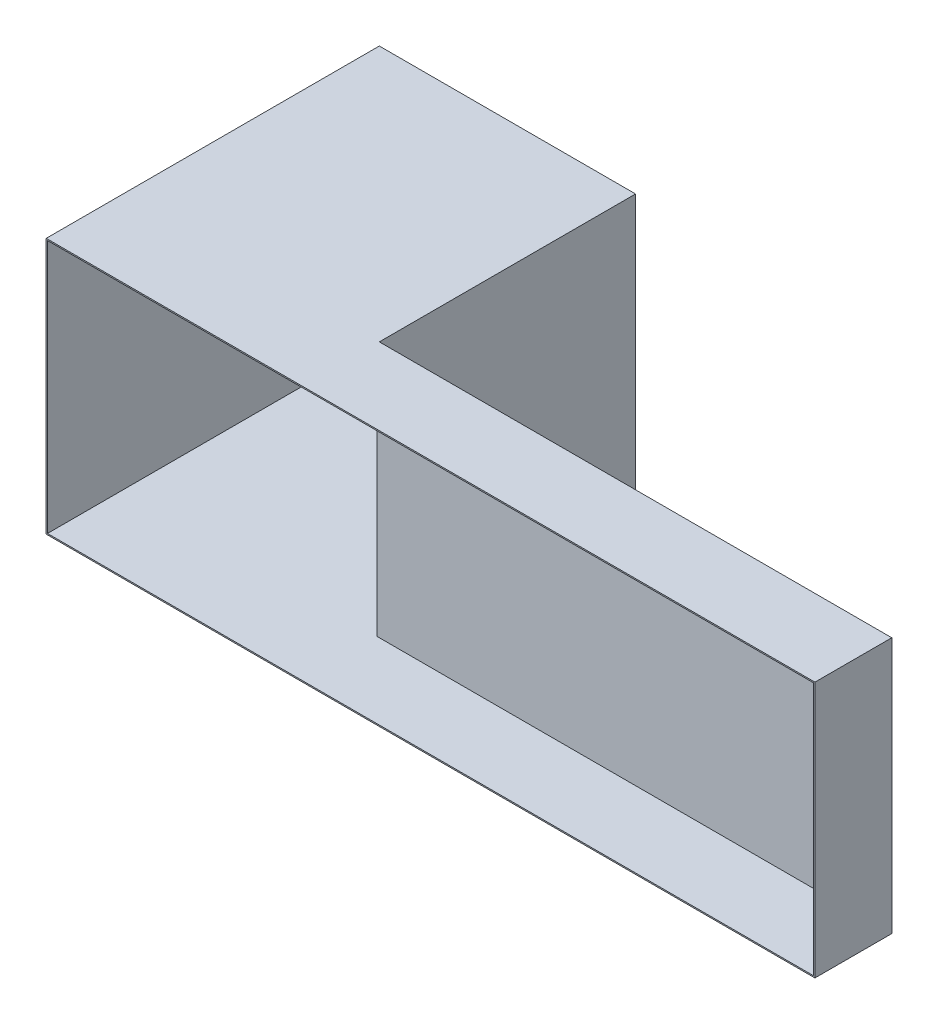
ISO-10303-21;
HEADER;
FILE_DESCRIPTION(('STEP AP214'),'2;1');
FILE_NAME('part.step','',(''),(''),'','','');
FILE_SCHEMA(('AUTOMOTIVE_DESIGN { 1 0 10303 214 1 1 1 1 }'));
ENDSEC;
DATA;
#1=APPLICATION_CONTEXT('core data for automotive mechanical design processes');
#2=APPLICATION_PROTOCOL_DEFINITION('international standard','automotive_design',2000,#1);
#3=PRODUCT_CONTEXT('',#1,'mechanical');
#4=PRODUCT('Part','Part','',(#3));
#5=PRODUCT_RELATED_PRODUCT_CATEGORY('part','',(#4));
#6=PRODUCT_DEFINITION_FORMATION('','',#4);
#7=PRODUCT_DEFINITION_CONTEXT('part definition',#1,'design');
#8=PRODUCT_DEFINITION('design','',#6,#7);
#9=PRODUCT_DEFINITION_SHAPE('','',#8);
#10=(LENGTH_UNIT() NAMED_UNIT(*) SI_UNIT(.MILLI.,.METRE.));
#11=(NAMED_UNIT(*) PLANE_ANGLE_UNIT() SI_UNIT($,.RADIAN.));
#12=(NAMED_UNIT(*) SI_UNIT($,.STERADIAN.) SOLID_ANGLE_UNIT());
#13=UNCERTAINTY_MEASURE_WITH_UNIT(LENGTH_MEASURE(1.E-05),#10,'distance_accuracy_value','');
#14=(GEOMETRIC_REPRESENTATION_CONTEXT(3) GLOBAL_UNCERTAINTY_ASSIGNED_CONTEXT((#13)) GLOBAL_UNIT_ASSIGNED_CONTEXT((#10,
#11,#12)) REPRESENTATION_CONTEXT('',''));
#15=CARTESIAN_POINT('',(0.,0.,0.));
#16=DIRECTION('',(0.,0.,1.));
#17=DIRECTION('',(1.,0.,0.));
#18=AXIS2_PLACEMENT_3D('',#15,#16,#17);
#19=CARTESIAN_POINT('',(0.,250.,150.));
#20=DIRECTION('',(0.,0.,-1.));
#21=DIRECTION('',(-1.,0.,0.));
#22=AXIS2_PLACEMENT_3D('',#19,#20,#21);
#23=PLANE('',#22);
#24=DIRECTION('',(0.,-1.,0.));
#25=VECTOR('',#24,1.);
#26=CARTESIAN_POINT('',(0.,-250.,150.));
#27=LINE('',#26,#25);
#28=CARTESIAN_POINT('',(0.,250.,150.));
#29=VERTEX_POINT('',#28);
#30=CARTESIAN_POINT('',(0.,-250.,150.));
#31=VERTEX_POINT('',#30);
#32=EDGE_CURVE('E191',#29,#31,#27,.T.);
#33=ORIENTED_EDGE('',*,*,#32,.T.);
#34=DIRECTION('',(1.,0.,0.));
#35=VECTOR('',#34,1.);
#36=CARTESIAN_POINT('',(0.,-250.,150.));
#37=LINE('',#36,#35);
#38=CARTESIAN_POINT('',(1500.,-250.,150.));
#39=VERTEX_POINT('',#38);
#40=EDGE_CURVE('E237',#31,#39,#37,.T.);
#41=ORIENTED_EDGE('',*,*,#40,.T.);
#42=DIRECTION('',(0.,1.,0.));
#43=VECTOR('',#42,1.);
#44=CARTESIAN_POINT('',(1500.,-250.,150.));
#45=LINE('',#44,#43);
#46=CARTESIAN_POINT('',(1500.,250.,150.));
#47=VERTEX_POINT('',#46);
#48=EDGE_CURVE('E234',#39,#47,#45,.T.);
#49=ORIENTED_EDGE('',*,*,#48,.T.);
#50=DIRECTION('',(-1.,0.,0.));
#51=VECTOR('',#50,1.);
#52=CARTESIAN_POINT('',(0.,250.,150.));
#53=LINE('',#52,#51);
#54=EDGE_CURVE('E228',#47,#29,#53,.T.);
#55=ORIENTED_EDGE('',*,*,#54,.T.);
#56=EDGE_LOOP('',(#33,#41,#49,#55));
#57=FACE_BOUND('',#56,.T.);
#58=DIRECTION('',(0.,-1.,0.));
#59=VECTOR('',#58,1.);
#60=CARTESIAN_POINT('',(2.5,250.,150.));
#61=LINE('',#60,#59);
#62=CARTESIAN_POINT('',(2.5,247.5,150.));
#63=VERTEX_POINT('',#62);
#64=CARTESIAN_POINT('',(2.5,-247.5,150.));
#65=VERTEX_POINT('',#64);
#66=EDGE_CURVE('E169',#63,#65,#61,.T.);
#67=ORIENTED_EDGE('',*,*,#66,.F.);
#68=DIRECTION('',(-1.,0.,0.));
#69=VECTOR('',#68,1.);
#70=CARTESIAN_POINT('',(0.,247.5,150.));
#71=LINE('',#70,#69);
#72=CARTESIAN_POINT('',(1497.5,247.5,150.));
#73=VERTEX_POINT('',#72);
#74=EDGE_CURVE('E129',#73,#63,#71,.T.);
#75=ORIENTED_EDGE('',*,*,#74,.F.);
#76=DIRECTION('',(0.,1.,0.));
#77=VECTOR('',#76,1.);
#78=CARTESIAN_POINT('',(1497.5,250.,150.));
#79=LINE('',#78,#77);
#80=CARTESIAN_POINT('',(1497.5,-247.5,150.));
#81=VERTEX_POINT('',#80);
#82=EDGE_CURVE('E175',#81,#73,#79,.T.);
#83=ORIENTED_EDGE('',*,*,#82,.F.);
#84=DIRECTION('',(1.,0.,0.));
#85=VECTOR('',#84,1.);
#86=CARTESIAN_POINT('',(0.,-247.5,150.));
#87=LINE('',#86,#85);
#88=EDGE_CURVE('E173',#65,#81,#87,.T.);
#89=ORIENTED_EDGE('',*,*,#88,.F.);
#90=EDGE_LOOP('',(#67,#75,#83,#89));
#91=FACE_BOUND('',#90,.T.);
#92=ADVANCED_FACE('F32',(#57,#91),#23,.F.);
#93=CARTESIAN_POINT('',(0.,-250.,150.));
#94=DIRECTION('',(1.,0.,0.));
#95=DIRECTION('',(0.,0.,-1.));
#96=AXIS2_PLACEMENT_3D('',#93,#94,#95);
#97=PLANE('',#96);
#98=DIRECTION('',(0.,0.,-1.));
#99=VECTOR('',#98,1.);
#100=CARTESIAN_POINT('',(0.,250.,150.));
#101=LINE('',#100,#99);
#102=CARTESIAN_POINT('',(0.,250.,-500.));
#103=VERTEX_POINT('',#102);
#104=EDGE_CURVE('E222',#29,#103,#101,.T.);
#105=ORIENTED_EDGE('',*,*,#104,.T.);
#106=DIRECTION('',(0.,1.,0.));
#107=VECTOR('',#106,1.);
#108=CARTESIAN_POINT('',(0.,-250.,-500.));
#109=LINE('',#108,#107);
#110=CARTESIAN_POINT('',(0.,-250.,-500.));
#111=VERTEX_POINT('',#110);
#112=EDGE_CURVE('E178',#111,#103,#109,.T.);
#113=ORIENTED_EDGE('',*,*,#112,.F.);
#114=DIRECTION('',(0.,0.,-1.));
#115=VECTOR('',#114,1.);
#116=CARTESIAN_POINT('',(0.,-250.,150.));
#117=LINE('',#116,#115);
#118=EDGE_CURVE('E11',#31,#111,#117,.T.);
#119=ORIENTED_EDGE('',*,*,#118,.F.);
#120=ORIENTED_EDGE('',*,*,#32,.F.);
#121=EDGE_LOOP('',(#105,#113,#119,#120));
#122=FACE_BOUND('',#121,.T.);
#123=ADVANCED_FACE('F34',(#122),#97,.F.);
#124=CARTESIAN_POINT('',(0.,-250.,150.));
#125=DIRECTION('',(0.,1.,0.));
#126=DIRECTION('',(0.,0.,1.));
#127=AXIS2_PLACEMENT_3D('',#124,#125,#126);
#128=PLANE('',#127);
#129=ORIENTED_EDGE('',*,*,#118,.T.);
#130=DIRECTION('',(-1.,0.,0.));
#131=VECTOR('',#130,1.);
#132=CARTESIAN_POINT('',(0.,-250.,-500.));
#133=LINE('',#132,#131);
#134=CARTESIAN_POINT('',(500.,-250.,-500.));
#135=VERTEX_POINT('',#134);
#136=EDGE_CURVE('E185',#135,#111,#133,.T.);
#137=ORIENTED_EDGE('',*,*,#136,.F.);
#138=DIRECTION('',(0.,0.,1.));
#139=VECTOR('',#138,1.);
#140=CARTESIAN_POINT('',(500.,-250.,-500.));
#141=LINE('',#140,#139);
#142=CARTESIAN_POINT('',(500.,-250.,0.));
#143=VERTEX_POINT('',#142);
#144=EDGE_CURVE('E188',#135,#143,#141,.T.);
#145=ORIENTED_EDGE('',*,*,#144,.T.);
#146=DIRECTION('',(1.,0.,0.));
#147=VECTOR('',#146,1.);
#148=CARTESIAN_POINT('',(0.,-250.,0.));
#149=LINE('',#148,#147);
#150=CARTESIAN_POINT('',(1500.,-250.,0.));
#151=VERTEX_POINT('',#150);
#152=EDGE_CURVE('E196',#143,#151,#149,.T.);
#153=ORIENTED_EDGE('',*,*,#152,.T.);
#154=DIRECTION('',(0.,0.,-1.));
#155=VECTOR('',#154,1.);
#156=CARTESIAN_POINT('',(1500.,-250.,150.));
#157=LINE('',#156,#155);
#158=EDGE_CURVE('E41',#39,#151,#157,.T.);
#159=ORIENTED_EDGE('',*,*,#158,.F.);
#160=ORIENTED_EDGE('',*,*,#40,.F.);
#161=EDGE_LOOP('',(#129,#137,#145,#153,#159,#160));
#162=FACE_BOUND('',#161,.T.);
#163=ADVANCED_FACE('F242',(#162),#128,.F.);
#164=CARTESIAN_POINT('',(1500.,-250.,150.));
#165=DIRECTION('',(-1.,0.,0.));
#166=DIRECTION('',(0.,0.,1.));
#167=AXIS2_PLACEMENT_3D('',#164,#165,#166);
#168=PLANE('',#167);
#169=DIRECTION('',(0.,1.,0.));
#170=VECTOR('',#169,1.);
#171=CARTESIAN_POINT('',(1500.,-250.,0.));
#172=LINE('',#171,#170);
#173=CARTESIAN_POINT('',(1500.,250.,0.));
#174=VERTEX_POINT('',#173);
#175=EDGE_CURVE('E207',#151,#174,#172,.T.);
#176=ORIENTED_EDGE('',*,*,#175,.T.);
#177=DIRECTION('',(0.,0.,-1.));
#178=VECTOR('',#177,1.);
#179=CARTESIAN_POINT('',(1500.,250.,150.));
#180=LINE('',#179,#178);
#181=EDGE_CURVE('E225',#47,#174,#180,.T.);
#182=ORIENTED_EDGE('',*,*,#181,.F.);
#183=ORIENTED_EDGE('',*,*,#48,.F.);
#184=ORIENTED_EDGE('',*,*,#158,.T.);
#185=EDGE_LOOP('',(#176,#182,#183,#184));
#186=FACE_BOUND('',#185,.T.);
#187=ADVANCED_FACE('F265',(#186),#168,.F.);
#188=CARTESIAN_POINT('',(0.,250.,150.));
#189=DIRECTION('',(0.,-1.,0.));
#190=DIRECTION('',(0.,0.,-1.));
#191=AXIS2_PLACEMENT_3D('',#188,#189,#190);
#192=PLANE('',#191);
#193=DIRECTION('',(-1.,0.,0.));
#194=VECTOR('',#193,1.);
#195=CARTESIAN_POINT('',(0.,250.,0.));
#196=LINE('',#195,#194);
#197=CARTESIAN_POINT('',(500.,250.,0.));
#198=VERTEX_POINT('',#197);
#199=EDGE_CURVE('E211',#174,#198,#196,.T.);
#200=ORIENTED_EDGE('',*,*,#199,.T.);
#201=DIRECTION('',(0.,0.,1.));
#202=VECTOR('',#201,1.);
#203=CARTESIAN_POINT('',(500.,250.,-500.));
#204=LINE('',#203,#202);
#205=CARTESIAN_POINT('',(500.,250.,-500.));
#206=VERTEX_POINT('',#205);
#207=EDGE_CURVE('E201',#206,#198,#204,.T.);
#208=ORIENTED_EDGE('',*,*,#207,.F.);
#209=DIRECTION('',(1.,0.,0.));
#210=VECTOR('',#209,1.);
#211=CARTESIAN_POINT('',(0.,250.,-500.));
#212=LINE('',#211,#210);
#213=EDGE_CURVE('E181',#103,#206,#212,.T.);
#214=ORIENTED_EDGE('',*,*,#213,.F.);
#215=ORIENTED_EDGE('',*,*,#104,.F.);
#216=ORIENTED_EDGE('',*,*,#54,.F.);
#217=ORIENTED_EDGE('',*,*,#181,.T.);
#218=EDGE_LOOP('',(#200,#208,#214,#215,#216,#217));
#219=FACE_BOUND('',#218,.T.);
#220=ADVANCED_FACE('F255',(#219),#192,.F.);
#221=CARTESIAN_POINT('',(0.,250.,0.));
#222=DIRECTION('',(0.,0.,-1.));
#223=DIRECTION('',(-1.,0.,0.));
#224=AXIS2_PLACEMENT_3D('',#221,#222,#223);
#225=PLANE('',#224);
#226=DIRECTION('',(0.,-1.,0.));
#227=VECTOR('',#226,1.);
#228=CARTESIAN_POINT('',(500.,-250.,0.));
#229=LINE('',#228,#227);
#230=EDGE_CURVE('E57',#198,#143,#229,.T.);
#231=ORIENTED_EDGE('',*,*,#230,.F.);
#232=ORIENTED_EDGE('',*,*,#199,.F.);
#233=ORIENTED_EDGE('',*,*,#175,.F.);
#234=ORIENTED_EDGE('',*,*,#152,.F.);
#235=EDGE_LOOP('',(#231,#232,#233,#234));
#236=FACE_BOUND('',#235,.T.);
#237=ADVANCED_FACE('F248',(#236),#225,.T.);
#238=CARTESIAN_POINT('',(500.,-250.,-500.));
#239=DIRECTION('',(-1.,0.,0.));
#240=DIRECTION('',(0.,0.,1.));
#241=AXIS2_PLACEMENT_3D('',#238,#239,#240);
#242=PLANE('',#241);
#243=ORIENTED_EDGE('',*,*,#230,.T.);
#244=ORIENTED_EDGE('',*,*,#144,.F.);
#245=DIRECTION('',(0.,-1.,0.));
#246=VECTOR('',#245,1.);
#247=CARTESIAN_POINT('',(500.,-250.,-500.));
#248=LINE('',#247,#246);
#249=EDGE_CURVE('E183',#206,#135,#248,.T.);
#250=ORIENTED_EDGE('',*,*,#249,.F.);
#251=ORIENTED_EDGE('',*,*,#207,.T.);
#252=EDGE_LOOP('',(#243,#244,#250,#251));
#253=FACE_BOUND('',#252,.T.);
#254=ADVANCED_FACE('F246',(#253),#242,.F.);
#255=CARTESIAN_POINT('',(0.,-250.,-500.));
#256=DIRECTION('',(0.,0.,-1.));
#257=DIRECTION('',(-1.,0.,0.));
#258=AXIS2_PLACEMENT_3D('',#255,#256,#257);
#259=PLANE('',#258);
#260=ORIENTED_EDGE('',*,*,#112,.T.);
#261=ORIENTED_EDGE('',*,*,#213,.T.);
#262=ORIENTED_EDGE('',*,*,#249,.T.);
#263=ORIENTED_EDGE('',*,*,#136,.T.);
#264=EDGE_LOOP('',(#260,#261,#262,#263));
#265=FACE_BOUND('',#264,.T.);
#266=ADVANCED_FACE('F244',(#265),#259,.T.);
#267=CARTESIAN_POINT('',(2.5,-250.,150.));
#268=DIRECTION('',(1.,0.,0.));
#269=DIRECTION('',(0.,0.,-1.));
#270=AXIS2_PLACEMENT_3D('',#267,#268,#269);
#271=PLANE('',#270);
#272=DIRECTION('',(0.,0.,-1.));
#273=VECTOR('',#272,1.);
#274=CARTESIAN_POINT('',(2.5,247.5,150.));
#275=LINE('',#274,#273);
#276=CARTESIAN_POINT('',(2.5,247.5,-497.5));
#277=VERTEX_POINT('',#276);
#278=EDGE_CURVE('E122',#63,#277,#275,.T.);
#279=ORIENTED_EDGE('',*,*,#278,.F.);
#280=ORIENTED_EDGE('',*,*,#66,.T.);
#281=DIRECTION('',(0.,0.,-1.));
#282=VECTOR('',#281,1.);
#283=CARTESIAN_POINT('',(2.5,-247.5,150.));
#284=LINE('',#283,#282);
#285=CARTESIAN_POINT('',(2.5,-247.5,-497.5));
#286=VERTEX_POINT('',#285);
#287=EDGE_CURVE('E144',#65,#286,#284,.T.);
#288=ORIENTED_EDGE('',*,*,#287,.T.);
#289=DIRECTION('',(0.,1.,0.));
#290=VECTOR('',#289,1.);
#291=CARTESIAN_POINT('',(2.5,-250.,-497.5));
#292=LINE('',#291,#290);
#293=EDGE_CURVE('E139',#286,#277,#292,.T.);
#294=ORIENTED_EDGE('',*,*,#293,.T.);
#295=EDGE_LOOP('',(#279,#280,#288,#294));
#296=FACE_BOUND('',#295,.T.);
#297=ADVANCED_FACE('F142',(#296),#271,.T.);
#298=CARTESIAN_POINT('',(0.,-247.5,150.));
#299=DIRECTION('',(0.,1.,0.));
#300=DIRECTION('',(0.,0.,1.));
#301=AXIS2_PLACEMENT_3D('',#298,#299,#300);
#302=PLANE('',#301);
#303=ORIENTED_EDGE('',*,*,#287,.F.);
#304=ORIENTED_EDGE('',*,*,#88,.T.);
#305=DIRECTION('',(0.,0.,-1.));
#306=VECTOR('',#305,1.);
#307=CARTESIAN_POINT('',(1497.5,-247.5,150.));
#308=LINE('',#307,#306);
#309=CARTESIAN_POINT('',(1497.5,-247.5,2.5));
#310=VERTEX_POINT('',#309);
#311=EDGE_CURVE('E152',#81,#310,#308,.T.);
#312=ORIENTED_EDGE('',*,*,#311,.T.);
#313=DIRECTION('',(1.,0.,0.));
#314=VECTOR('',#313,1.);
#315=CARTESIAN_POINT('',(0.,-247.5,2.5));
#316=LINE('',#315,#314);
#317=CARTESIAN_POINT('',(497.5,-247.5,2.5));
#318=VERTEX_POINT('',#317);
#319=EDGE_CURVE('E159',#318,#310,#316,.T.);
#320=ORIENTED_EDGE('',*,*,#319,.F.);
#321=DIRECTION('',(0.,0.,1.));
#322=VECTOR('',#321,1.);
#323=CARTESIAN_POINT('',(497.5,-247.5,150.));
#324=LINE('',#323,#322);
#325=CARTESIAN_POINT('',(497.5,-247.5,-497.5));
#326=VERTEX_POINT('',#325);
#327=EDGE_CURVE('E155',#326,#318,#324,.T.);
#328=ORIENTED_EDGE('',*,*,#327,.F.);
#329=DIRECTION('',(-1.,0.,0.));
#330=VECTOR('',#329,1.);
#331=CARTESIAN_POINT('',(0.,-247.5,-497.5));
#332=LINE('',#331,#330);
#333=EDGE_CURVE('E153',#326,#286,#332,.T.);
#334=ORIENTED_EDGE('',*,*,#333,.T.);
#335=EDGE_LOOP('',(#303,#304,#312,#320,#328,#334));
#336=FACE_BOUND('',#335,.T.);
#337=ADVANCED_FACE('F310',(#336),#302,.T.);
#338=CARTESIAN_POINT('',(1497.5,-250.,150.));
#339=DIRECTION('',(-1.,0.,0.));
#340=DIRECTION('',(0.,0.,1.));
#341=AXIS2_PLACEMENT_3D('',#338,#339,#340);
#342=PLANE('',#341);
#343=DIRECTION('',(0.,1.,0.));
#344=VECTOR('',#343,1.);
#345=CARTESIAN_POINT('',(1497.5,250.,2.5));
#346=LINE('',#345,#344);
#347=CARTESIAN_POINT('',(1497.5,247.5,2.5));
#348=VERTEX_POINT('',#347);
#349=EDGE_CURVE('E161',#310,#348,#346,.T.);
#350=ORIENTED_EDGE('',*,*,#349,.F.);
#351=ORIENTED_EDGE('',*,*,#311,.F.);
#352=ORIENTED_EDGE('',*,*,#82,.T.);
#353=DIRECTION('',(0.,0.,-1.));
#354=VECTOR('',#353,1.);
#355=CARTESIAN_POINT('',(1497.5,247.5,150.));
#356=LINE('',#355,#354);
#357=EDGE_CURVE('E49',#73,#348,#356,.T.);
#358=ORIENTED_EDGE('',*,*,#357,.T.);
#359=EDGE_LOOP('',(#350,#351,#352,#358));
#360=FACE_BOUND('',#359,.T.);
#361=ADVANCED_FACE('F320',(#360),#342,.T.);
#362=CARTESIAN_POINT('',(0.,247.5,150.));
#363=DIRECTION('',(0.,-1.,0.));
#364=DIRECTION('',(0.,0.,-1.));
#365=AXIS2_PLACEMENT_3D('',#362,#363,#364);
#366=PLANE('',#365);
#367=DIRECTION('',(-1.,0.,0.));
#368=VECTOR('',#367,1.);
#369=CARTESIAN_POINT('',(0.,247.5,2.5));
#370=LINE('',#369,#368);
#371=CARTESIAN_POINT('',(497.5,247.5,2.5));
#372=VERTEX_POINT('',#371);
#373=EDGE_CURVE('E165',#348,#372,#370,.T.);
#374=ORIENTED_EDGE('',*,*,#373,.F.);
#375=ORIENTED_EDGE('',*,*,#357,.F.);
#376=ORIENTED_EDGE('',*,*,#74,.T.);
#377=ORIENTED_EDGE('',*,*,#278,.T.);
#378=DIRECTION('',(1.,0.,0.));
#379=VECTOR('',#378,1.);
#380=CARTESIAN_POINT('',(0.,247.5,-497.5));
#381=LINE('',#380,#379);
#382=CARTESIAN_POINT('',(497.5,247.5,-497.5));
#383=VERTEX_POINT('',#382);
#384=EDGE_CURVE('E126',#277,#383,#381,.T.);
#385=ORIENTED_EDGE('',*,*,#384,.T.);
#386=DIRECTION('',(0.,0.,1.));
#387=VECTOR('',#386,1.);
#388=CARTESIAN_POINT('',(497.5,247.5,-500.));
#389=LINE('',#388,#387);
#390=EDGE_CURVE('E158',#383,#372,#389,.T.);
#391=ORIENTED_EDGE('',*,*,#390,.T.);
#392=EDGE_LOOP('',(#374,#375,#376,#377,#385,#391));
#393=FACE_BOUND('',#392,.T.);
#394=ADVANCED_FACE('F124',(#393),#366,.T.);
#395=CARTESIAN_POINT('',(0.,250.,2.5));
#396=DIRECTION('',(0.,0.,-1.));
#397=DIRECTION('',(-1.,0.,0.));
#398=AXIS2_PLACEMENT_3D('',#395,#396,#397);
#399=PLANE('',#398);
#400=DIRECTION('',(0.,-1.,0.));
#401=VECTOR('',#400,1.);
#402=CARTESIAN_POINT('',(497.5,-250.,2.49999999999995));
#403=LINE('',#402,#401);
#404=EDGE_CURVE('E146',#372,#318,#403,.T.);
#405=ORIENTED_EDGE('',*,*,#404,.T.);
#406=ORIENTED_EDGE('',*,*,#319,.T.);
#407=ORIENTED_EDGE('',*,*,#349,.T.);
#408=ORIENTED_EDGE('',*,*,#373,.T.);
#409=EDGE_LOOP('',(#405,#406,#407,#408));
#410=FACE_BOUND('',#409,.T.);
#411=ADVANCED_FACE('F340',(#410),#399,.F.);
#412=CARTESIAN_POINT('',(497.5,-250.,-500.));
#413=DIRECTION('',(-1.,0.,0.));
#414=DIRECTION('',(0.,0.,1.));
#415=AXIS2_PLACEMENT_3D('',#412,#413,#414);
#416=PLANE('',#415);
#417=ORIENTED_EDGE('',*,*,#404,.F.);
#418=ORIENTED_EDGE('',*,*,#390,.F.);
#419=DIRECTION('',(0.,-1.,0.));
#420=VECTOR('',#419,1.);
#421=CARTESIAN_POINT('',(497.5,-250.,-497.5));
#422=LINE('',#421,#420);
#423=EDGE_CURVE('E140',#383,#326,#422,.T.);
#424=ORIENTED_EDGE('',*,*,#423,.T.);
#425=ORIENTED_EDGE('',*,*,#327,.T.);
#426=EDGE_LOOP('',(#417,#418,#424,#425));
#427=FACE_BOUND('',#426,.T.);
#428=ADVANCED_FACE('F349',(#427),#416,.T.);
#429=CARTESIAN_POINT('',(0.,-250.,-497.5));
#430=DIRECTION('',(0.,0.,-1.));
#431=DIRECTION('',(-1.,0.,0.));
#432=AXIS2_PLACEMENT_3D('',#429,#430,#431);
#433=PLANE('',#432);
#434=ORIENTED_EDGE('',*,*,#293,.F.);
#435=ORIENTED_EDGE('',*,*,#333,.F.);
#436=ORIENTED_EDGE('',*,*,#423,.F.);
#437=ORIENTED_EDGE('',*,*,#384,.F.);
#438=EDGE_LOOP('',(#434,#435,#436,#437));
#439=FACE_BOUND('',#438,.T.);
#440=ADVANCED_FACE('F137',(#439),#433,.F.);
#441=CLOSED_SHELL('',(#92,#123,#163,#187,#220,#237,#254,#266,#297,#337,#361,#394,#411,#428,#440));
#442=MANIFOLD_SOLID_BREP('B2',#441);
#443=ADVANCED_BREP_SHAPE_REPRESENTATION('',(#18,#442),#14);
#444=SHAPE_DEFINITION_REPRESENTATION(#9,#443);
ENDSEC;
END-ISO-10303-21;
